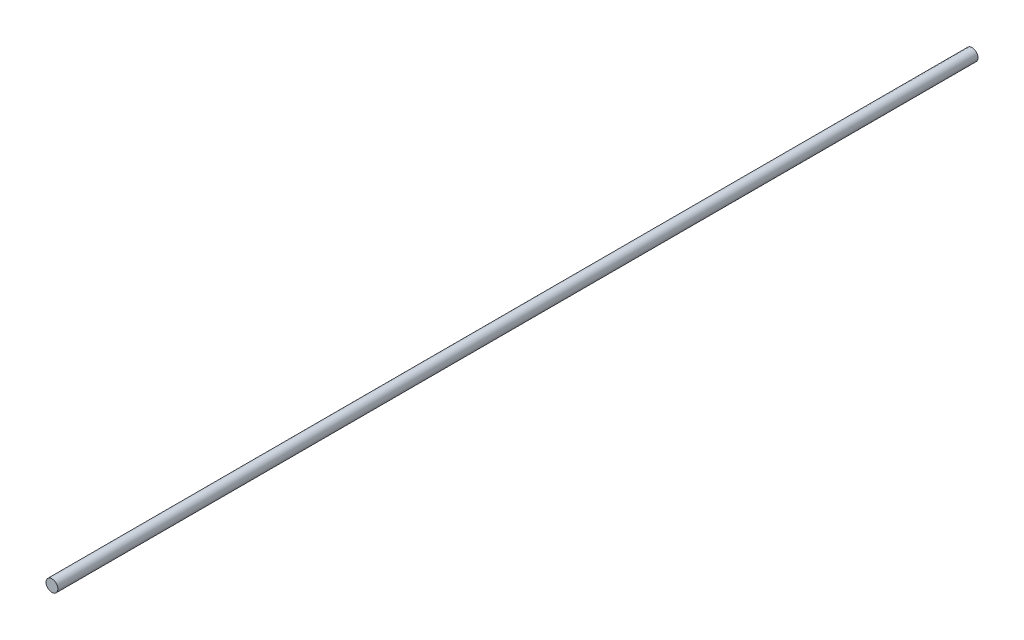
from build123d import *

# Parameters (mm, degrees)
SKETCH1_R           = 30
BOSS_EXTRUDE1_DEPTH = 4650


with BuildPart() as part:
    # Sketch1 → Boss-Extrude1 (new body)
    with BuildSketch(Plane.XY):
        Circle(SKETCH1_R)
    extrude(amount=-BOSS_EXTRUDE1_DEPTH)


solid = part.part
